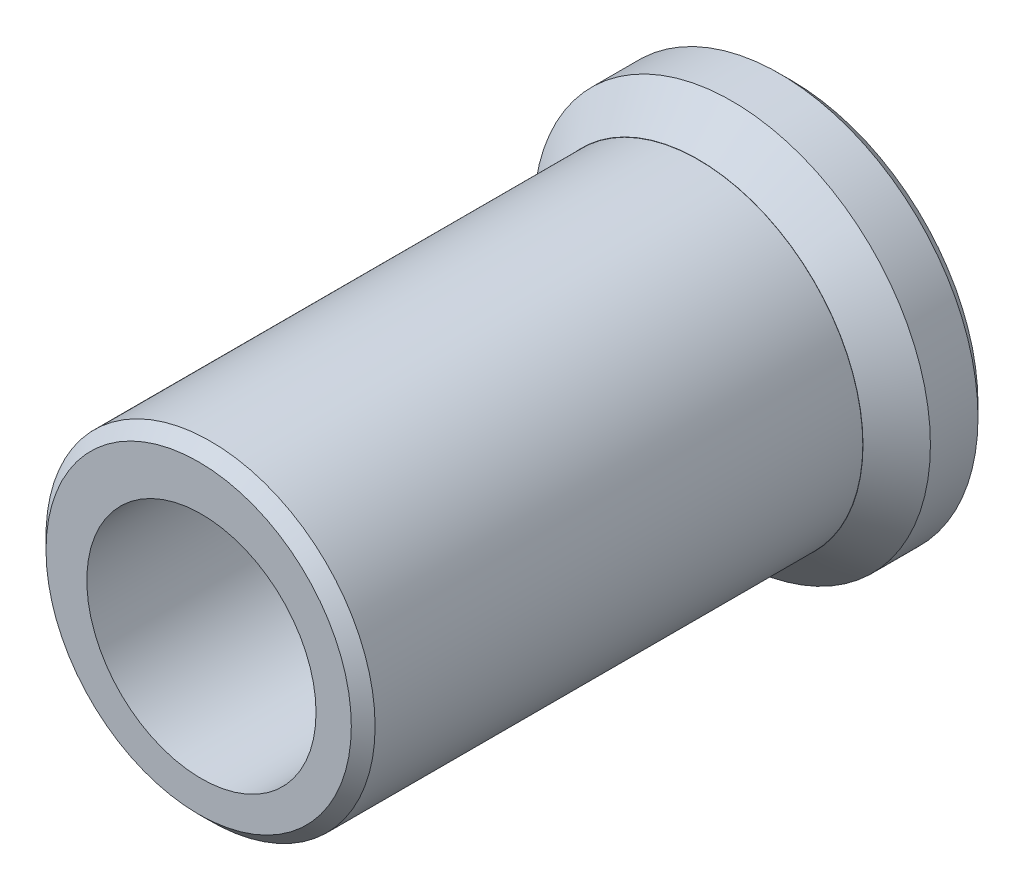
ISO-10303-21;
HEADER;
FILE_DESCRIPTION(('STEP AP214'),'2;1');
FILE_NAME('part.step','',(''),(''),'','','');
FILE_SCHEMA(('AUTOMOTIVE_DESIGN { 1 0 10303 214 1 1 1 1 }'));
ENDSEC;
DATA;
#1=APPLICATION_CONTEXT('core data for automotive mechanical design processes');
#2=APPLICATION_PROTOCOL_DEFINITION('international standard','automotive_design',2000,#1);
#3=PRODUCT_CONTEXT('',#1,'mechanical');
#4=PRODUCT('Part','Part','',(#3));
#5=PRODUCT_RELATED_PRODUCT_CATEGORY('part','',(#4));
#6=PRODUCT_DEFINITION_FORMATION('','',#4);
#7=PRODUCT_DEFINITION_CONTEXT('part definition',#1,'design');
#8=PRODUCT_DEFINITION('design','',#6,#7);
#9=PRODUCT_DEFINITION_SHAPE('','',#8);
#10=(LENGTH_UNIT() NAMED_UNIT(*) SI_UNIT(.MILLI.,.METRE.));
#11=(NAMED_UNIT(*) PLANE_ANGLE_UNIT() SI_UNIT($,.RADIAN.));
#12=(NAMED_UNIT(*) SI_UNIT($,.STERADIAN.) SOLID_ANGLE_UNIT());
#13=UNCERTAINTY_MEASURE_WITH_UNIT(LENGTH_MEASURE(1.E-05),#10,'distance_accuracy_value','');
#14=(GEOMETRIC_REPRESENTATION_CONTEXT(3) GLOBAL_UNCERTAINTY_ASSIGNED_CONTEXT((#13)) GLOBAL_UNIT_ASSIGNED_CONTEXT((#10,
#11,#12)) REPRESENTATION_CONTEXT('',''));
#15=CARTESIAN_POINT('',(0.,0.,0.));
#16=DIRECTION('',(0.,0.,1.));
#17=DIRECTION('',(1.,0.,0.));
#18=AXIS2_PLACEMENT_3D('',#15,#16,#17);
#19=CARTESIAN_POINT('',(0.,0.,5.969));
#20=DIRECTION('',(0.,0.,1.));
#21=DIRECTION('',(1.,0.,0.));
#22=AXIS2_PLACEMENT_3D('',#19,#20,#21);
#23=PLANE('',#22);
#24=CARTESIAN_POINT('',(0.,0.,5.969));
#25=DIRECTION('',(0.,0.,1.));
#26=DIRECTION('',(1.,0.,0.));
#27=AXIS2_PLACEMENT_3D('',#24,#25,#26);
#28=CIRCLE('',#27,10.5537);
#29=CARTESIAN_POINT('',(10.5537,0.,5.969));
#30=VERTEX_POINT('',#29);
#31=EDGE_CURVE('E48',#30,#30,#28,.T.);
#32=ORIENTED_EDGE('',*,*,#31,.T.);
#33=EDGE_LOOP('',(#32));
#34=FACE_BOUND('',#33,.T.);
#35=CARTESIAN_POINT('',(0.,0.,5.969));
#36=DIRECTION('',(0.,0.,1.));
#37=DIRECTION('',(1.,0.,0.));
#38=AXIS2_PLACEMENT_3D('',#35,#36,#37);
#39=CIRCLE('',#38,10.541);
#40=CARTESIAN_POINT('',(10.541,0.,5.969));
#41=VERTEX_POINT('',#40);
#42=EDGE_CURVE('E65',#41,#41,#39,.F.);
#43=ORIENTED_EDGE('',*,*,#42,.T.);
#44=EDGE_LOOP('',(#43));
#45=FACE_BOUND('',#44,.T.);
#46=ADVANCED_FACE('F33',(#34,#45),#23,.T.);
#47=CARTESIAN_POINT('',(0.,0.,5.969));
#48=DIRECTION('',(0.,0.,-1.));
#49=DIRECTION('',(-1.,0.,0.));
#50=AXIS2_PLACEMENT_3D('',#47,#48,#49);
#51=CYLINDRICAL_SURFACE('',#50,12.7127);
#52=CARTESIAN_POINT('',(0.,0.,3.80999999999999));
#53=DIRECTION('',(0.,0.,1.));
#54=DIRECTION('',(1.,0.,0.));
#55=AXIS2_PLACEMENT_3D('',#52,#53,#54);
#56=CIRCLE('',#55,12.7127);
#57=CARTESIAN_POINT('',(12.7127,0.,3.80999999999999));
#58=VERTEX_POINT('',#57);
#59=EDGE_CURVE('E44',#58,#58,#56,.F.);
#60=ORIENTED_EDGE('',*,*,#59,.T.);
#61=EDGE_LOOP('',(#60));
#62=FACE_BOUND('',#61,.T.);
#63=CARTESIAN_POINT('',(0.,0.,0.761999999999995));
#64=DIRECTION('',(0.,0.,1.));
#65=DIRECTION('',(1.,0.,0.));
#66=AXIS2_PLACEMENT_3D('',#63,#64,#65);
#67=CIRCLE('',#66,12.7127);
#68=CARTESIAN_POINT('',(12.7127,0.,0.761999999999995));
#69=VERTEX_POINT('',#68);
#70=EDGE_CURVE('E62',#69,#69,#67,.T.);
#71=ORIENTED_EDGE('',*,*,#70,.T.);
#72=EDGE_LOOP('',(#71));
#73=FACE_BOUND('',#72,.T.);
#74=ADVANCED_FACE('F96',(#62,#73),#51,.T.);
#75=CARTESIAN_POINT('',(0.,0.,0.));
#76=DIRECTION('',(0.,0.,1.));
#77=DIRECTION('',(1.,0.,0.));
#78=AXIS2_PLACEMENT_3D('',#75,#76,#77);
#79=PLANE('',#78);
#80=CARTESIAN_POINT('',(0.17750288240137,-0.373113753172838,0.));
#81=DIRECTION('',(0.,0.,1.));
#82=DIRECTION('',(1.,0.,0.));
#83=AXIS2_PLACEMENT_3D('',#80,#81,#82);
#84=CIRCLE('',#83,8.61186999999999);
#85=CARTESIAN_POINT('',(8.78937288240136,-0.373113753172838,0.));
#86=VERTEX_POINT('',#85);
#87=EDGE_CURVE('E40',#86,#86,#84,.T.);
#88=ORIENTED_EDGE('',*,*,#87,.T.);
#89=EDGE_LOOP('',(#88));
#90=FACE_BOUND('',#89,.T.);
#91=CARTESIAN_POINT('',(0.,0.,0.));
#92=DIRECTION('',(0.,0.,1.));
#93=DIRECTION('',(1.,0.,0.));
#94=AXIS2_PLACEMENT_3D('',#91,#92,#93);
#95=CIRCLE('',#94,11.9507);
#96=CARTESIAN_POINT('',(11.9507,0.,0.));
#97=VERTEX_POINT('',#96);
#98=EDGE_CURVE('E59',#97,#97,#95,.F.);
#99=ORIENTED_EDGE('',*,*,#98,.T.);
#100=EDGE_LOOP('',(#99));
#101=FACE_BOUND('',#100,.T.);
#102=ADVANCED_FACE('F102',(#90,#101),#79,.F.);
#103=CARTESIAN_POINT('',(0.,0.,37.973));
#104=DIRECTION('',(0.,0.,-1.));
#105=DIRECTION('',(-1.,0.,0.));
#106=AXIS2_PLACEMENT_3D('',#103,#104,#105);
#107=CYLINDRICAL_SURFACE('',#106,10.541);
#108=CARTESIAN_POINT('',(0.,0.,37.211));
#109=DIRECTION('',(0.,0.,1.));
#110=DIRECTION('',(1.,0.,0.));
#111=AXIS2_PLACEMENT_3D('',#108,#109,#110);
#112=CIRCLE('',#111,10.541);
#113=CARTESIAN_POINT('',(10.541,0.,37.211));
#114=VERTEX_POINT('',#113);
#115=EDGE_CURVE('E53',#114,#114,#112,.F.);
#116=ORIENTED_EDGE('',*,*,#115,.T.);
#117=EDGE_LOOP('',(#116));
#118=FACE_BOUND('',#117,.T.);
#119=ORIENTED_EDGE('',*,*,#42,.F.);
#120=EDGE_LOOP('',(#119));
#121=FACE_BOUND('',#120,.T.);
#122=ADVANCED_FACE('F78',(#118,#121),#107,.T.);
#123=CARTESIAN_POINT('',(0.,0.,37.973));
#124=DIRECTION('',(0.,0.,1.));
#125=DIRECTION('',(1.,0.,0.));
#126=AXIS2_PLACEMENT_3D('',#123,#124,#125);
#127=PLANE('',#126);
#128=CARTESIAN_POINT('',(0.17750288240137,-0.373113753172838,37.973));
#129=DIRECTION('',(0.,0.,1.));
#130=DIRECTION('',(1.,0.,0.));
#131=AXIS2_PLACEMENT_3D('',#128,#129,#130);
#132=CIRCLE('',#131,7.34186999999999);
#133=CARTESIAN_POINT('',(7.51937288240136,-0.373113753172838,37.973));
#134=VERTEX_POINT('',#133);
#135=EDGE_CURVE('E68',#134,#134,#132,.T.);
#136=ORIENTED_EDGE('',*,*,#135,.F.);
#137=EDGE_LOOP('',(#136));
#138=FACE_BOUND('',#137,.T.);
#139=CARTESIAN_POINT('',(0.,0.,37.973));
#140=DIRECTION('',(0.,0.,1.));
#141=DIRECTION('',(1.,0.,0.));
#142=AXIS2_PLACEMENT_3D('',#139,#140,#141);
#143=CIRCLE('',#142,9.779);
#144=CARTESIAN_POINT('',(9.779,0.,37.973));
#145=VERTEX_POINT('',#144);
#146=EDGE_CURVE('E56',#145,#145,#143,.T.);
#147=ORIENTED_EDGE('',*,*,#146,.T.);
#148=EDGE_LOOP('',(#147));
#149=FACE_BOUND('',#148,.T.);
#150=ADVANCED_FACE('F74',(#138,#149),#127,.T.);
#151=CARTESIAN_POINT('',(0.,0.,0.761999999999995));
#152=DIRECTION('',(0.,0.,1.));
#153=DIRECTION('',(1.,0.,0.));
#154=AXIS2_PLACEMENT_3D('',#151,#152,#153);
#155=CONICAL_SURFACE('',#154,12.7127,0.785398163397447);
#156=ORIENTED_EDGE('',*,*,#98,.F.);
#157=EDGE_LOOP('',(#156));
#158=FACE_BOUND('',#157,.T.);
#159=ORIENTED_EDGE('',*,*,#70,.F.);
#160=EDGE_LOOP('',(#159));
#161=FACE_BOUND('',#160,.T.);
#162=ADVANCED_FACE('F77',(#158,#161),#155,.T.);
#163=CARTESIAN_POINT('',(0.,0.,37.973));
#164=DIRECTION('',(0.,0.,-1.));
#165=DIRECTION('',(-1.,0.,0.));
#166=AXIS2_PLACEMENT_3D('',#163,#164,#165);
#167=CONICAL_SURFACE('',#166,9.779,0.785398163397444);
#168=ORIENTED_EDGE('',*,*,#115,.F.);
#169=EDGE_LOOP('',(#168));
#170=FACE_BOUND('',#169,.T.);
#171=ORIENTED_EDGE('',*,*,#146,.F.);
#172=EDGE_LOOP('',(#171));
#173=FACE_BOUND('',#172,.T.);
#174=ADVANCED_FACE('F82',(#170,#173),#167,.T.);
#175=CARTESIAN_POINT('',(0.,0.,5.969));
#176=DIRECTION('',(0.,0.,-1.));
#177=DIRECTION('',(-1.,0.,0.));
#178=AXIS2_PLACEMENT_3D('',#175,#176,#177);
#179=CONICAL_SURFACE('',#178,10.5537,0.785398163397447);
#180=ORIENTED_EDGE('',*,*,#59,.F.);
#181=EDGE_LOOP('',(#180));
#182=FACE_BOUND('',#181,.T.);
#183=ORIENTED_EDGE('',*,*,#31,.F.);
#184=EDGE_LOOP('',(#183));
#185=FACE_BOUND('',#184,.T.);
#186=ADVANCED_FACE('F84',(#182,#185),#179,.T.);
#187=CARTESIAN_POINT('',(0.17750288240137,-0.373113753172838,37.973));
#188=DIRECTION('',(0.,0.,1.));
#189=DIRECTION('',(1.,0.,0.));
#190=AXIS2_PLACEMENT_3D('',#187,#188,#189);
#191=CYLINDRICAL_SURFACE('',#190,7.34186999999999);
#192=CARTESIAN_POINT('',(0.17750288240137,-0.373113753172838,1.27000000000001));
#193=DIRECTION('',(0.,0.,1.));
#194=DIRECTION('',(1.,0.,0.));
#195=AXIS2_PLACEMENT_3D('',#192,#193,#194);
#196=CIRCLE('',#195,7.34186999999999);
#197=CARTESIAN_POINT('',(7.51937288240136,-0.373113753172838,1.27000000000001));
#198=VERTEX_POINT('',#197);
#199=EDGE_CURVE('E10',#198,#198,#196,.F.);
#200=ORIENTED_EDGE('',*,*,#199,.T.);
#201=EDGE_LOOP('',(#200));
#202=FACE_BOUND('',#201,.T.);
#203=ORIENTED_EDGE('',*,*,#135,.T.);
#204=EDGE_LOOP('',(#203));
#205=FACE_BOUND('',#204,.T.);
#206=ADVANCED_FACE('F72',(#202,#205),#191,.F.);
#207=CARTESIAN_POINT('',(0.17750288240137,-0.373113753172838,0.));
#208=DIRECTION('',(0.,0.,-1.));
#209=DIRECTION('',(-1.,0.,0.));
#210=AXIS2_PLACEMENT_3D('',#207,#208,#209);
#211=CONICAL_SURFACE('',#210,8.61186999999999,0.785398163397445);
#212=ORIENTED_EDGE('',*,*,#199,.F.);
#213=EDGE_LOOP('',(#212));
#214=FACE_BOUND('',#213,.T.);
#215=ORIENTED_EDGE('',*,*,#87,.F.);
#216=EDGE_LOOP('',(#215));
#217=FACE_BOUND('',#216,.T.);
#218=ADVANCED_FACE('F35',(#214,#217),#211,.F.);
#219=CLOSED_SHELL('',(#46,#74,#102,#122,#150,#162,#174,#186,#206,#218));
#220=MANIFOLD_SOLID_BREP('B2',#219);
#221=ADVANCED_BREP_SHAPE_REPRESENTATION('',(#18,#220),#14);
#222=SHAPE_DEFINITION_REPRESENTATION(#9,#221);
ENDSEC;
END-ISO-10303-21;
